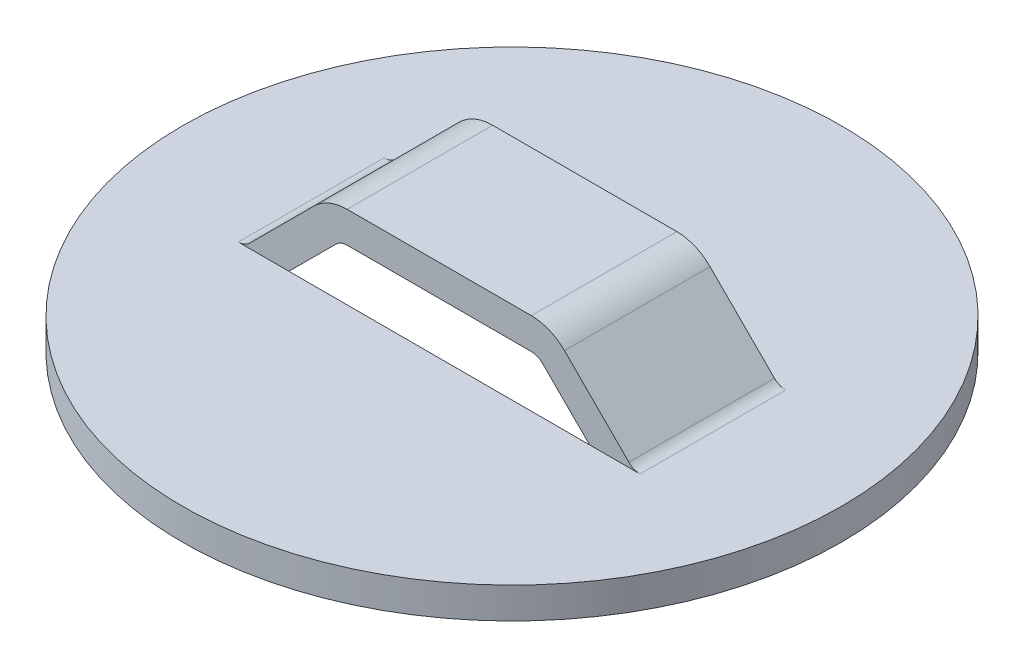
ISO-10303-21;
HEADER;
FILE_DESCRIPTION(('STEP AP214'),'2;1');
FILE_NAME('part.step','',(''),(''),'','','');
FILE_SCHEMA(('AUTOMOTIVE_DESIGN { 1 0 10303 214 1 1 1 1 }'));
ENDSEC;
DATA;
#1=APPLICATION_CONTEXT('core data for automotive mechanical design processes');
#2=APPLICATION_PROTOCOL_DEFINITION('international standard','automotive_design',2000,#1);
#3=PRODUCT_CONTEXT('',#1,'mechanical');
#4=PRODUCT('Part','Part','',(#3));
#5=PRODUCT_RELATED_PRODUCT_CATEGORY('part','',(#4));
#6=PRODUCT_DEFINITION_FORMATION('','',#4);
#7=PRODUCT_DEFINITION_CONTEXT('part definition',#1,'design');
#8=PRODUCT_DEFINITION('design','',#6,#7);
#9=PRODUCT_DEFINITION_SHAPE('','',#8);
#10=(LENGTH_UNIT() NAMED_UNIT(*) SI_UNIT(.MILLI.,.METRE.));
#11=(NAMED_UNIT(*) PLANE_ANGLE_UNIT() SI_UNIT($,.RADIAN.));
#12=(NAMED_UNIT(*) SI_UNIT($,.STERADIAN.) SOLID_ANGLE_UNIT());
#13=UNCERTAINTY_MEASURE_WITH_UNIT(LENGTH_MEASURE(1.E-05),#10,'distance_accuracy_value','');
#14=(GEOMETRIC_REPRESENTATION_CONTEXT(3) GLOBAL_UNCERTAINTY_ASSIGNED_CONTEXT((#13)) GLOBAL_UNIT_ASSIGNED_CONTEXT((#10,
#11,#12)) REPRESENTATION_CONTEXT('',''));
#15=CARTESIAN_POINT('',(0.,0.,0.));
#16=DIRECTION('',(0.,0.,1.));
#17=DIRECTION('',(1.,0.,0.));
#18=AXIS2_PLACEMENT_3D('',#15,#16,#17);
#19=CARTESIAN_POINT('',(-9.67553073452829,0.762,0.));
#20=DIRECTION('',(0.,0.,-1.));
#21=DIRECTION('',(-1.,0.,0.));
#22=AXIS2_PLACEMENT_3D('',#19,#20,#21);
#23=PLANE('',#22);
#24=DIRECTION('',(-1.,0.,0.));
#25=VECTOR('',#24,1.);
#26=CARTESIAN_POINT('',(-9.67553073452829,0.,0.));
#27=LINE('',#26,#25);
#28=CARTESIAN_POINT('',(-7.24055955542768,0.,0.));
#29=VERTEX_POINT('',#28);
#30=CARTESIAN_POINT('',(-9.67553073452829,0.,0.));
#31=VERTEX_POINT('',#30);
#32=EDGE_CURVE('E178',#29,#31,#27,.T.);
#33=ORIENTED_EDGE('',*,*,#32,.F.);
#34=DIRECTION('',(-0.707106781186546,-0.707106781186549,0.));
#35=VECTOR('',#34,1.);
#36=CARTESIAN_POINT('',(-4.97454418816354,2.26601536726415,0.));
#37=LINE('',#36,#35);
#38=CARTESIAN_POINT('',(-4.97454418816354,2.26601536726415,0.));
#39=VERTEX_POINT('',#38);
#40=EDGE_CURVE('E248',#39,#29,#37,.T.);
#41=ORIENTED_EDGE('',*,*,#40,.F.);
#42=CARTESIAN_POINT('',(-4.43572882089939,1.7272,0.));
#43=DIRECTION('',(0.,0.,1.));
#44=DIRECTION('',(1.,0.,0.));
#45=AXIS2_PLACEMENT_3D('',#42,#43,#44);
#46=CIRCLE('',#45,0.762);
#47=CARTESIAN_POINT('',(-4.43572882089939,2.4892,0.));
#48=VERTEX_POINT('',#47);
#49=EDGE_CURVE('E249',#48,#39,#46,.T.);
#50=ORIENTED_EDGE('',*,*,#49,.F.);
#51=DIRECTION('',(-1.,0.,0.));
#52=VECTOR('',#51,1.);
#53=CARTESIAN_POINT('',(-9.67553073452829,2.4892,0.));
#54=LINE('',#53,#52);
#55=CARTESIAN_POINT('',(4.43572882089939,2.4892,0.));
#56=VERTEX_POINT('',#55);
#57=EDGE_CURVE('E252',#56,#48,#54,.T.);
#58=ORIENTED_EDGE('',*,*,#57,.F.);
#59=CARTESIAN_POINT('',(4.43572882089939,1.7272,0.));
#60=DIRECTION('',(0.,0.,1.));
#61=DIRECTION('',(1.,0.,0.));
#62=AXIS2_PLACEMENT_3D('',#59,#60,#61);
#63=CIRCLE('',#62,0.762);
#64=CARTESIAN_POINT('',(4.97454418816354,2.26601536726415,0.));
#65=VERTEX_POINT('',#64);
#66=EDGE_CURVE('E253',#65,#56,#63,.T.);
#67=ORIENTED_EDGE('',*,*,#66,.F.);
#68=DIRECTION('',(-0.707106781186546,0.707106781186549,0.));
#69=VECTOR('',#68,1.);
#70=CARTESIAN_POINT('',(8.07704514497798,-0.836485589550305,0.));
#71=LINE('',#70,#69);
#72=CARTESIAN_POINT('',(7.24055955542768,0.,0.));
#73=VERTEX_POINT('',#72);
#74=EDGE_CURVE('E170',#73,#65,#71,.T.);
#75=ORIENTED_EDGE('',*,*,#74,.F.);
#76=CARTESIAN_POINT('',(9.67553073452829,0.,0.));
#77=VERTEX_POINT('',#76);
#78=EDGE_CURVE('E165',#77,#73,#27,.T.);
#79=ORIENTED_EDGE('',*,*,#78,.F.);
#80=CARTESIAN_POINT('',(9.67553073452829,0.762,0.));
#81=DIRECTION('',(0.,0.,1.));
#82=DIRECTION('',(1.,0.,0.));
#83=AXIS2_PLACEMENT_3D('',#80,#81,#82);
#84=CIRCLE('',#83,0.761999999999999);
#85=CARTESIAN_POINT('',(9.13671536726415,0.223184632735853,0.));
#86=VERTEX_POINT('',#85);
#87=EDGE_CURVE('E168',#86,#77,#84,.T.);
#88=ORIENTED_EDGE('',*,*,#87,.F.);
#89=DIRECTION('',(0.707106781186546,-0.707106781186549,0.));
#90=VECTOR('',#89,1.);
#91=CARTESIAN_POINT('',(6.0342144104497,3.32568558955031,0.));
#92=LINE('',#91,#90);
#93=CARTESIAN_POINT('',(6.0342144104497,3.32568558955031,0.));
#94=VERTEX_POINT('',#93);
#95=EDGE_CURVE('E186',#94,#86,#92,.T.);
#96=ORIENTED_EDGE('',*,*,#95,.F.);
#97=CARTESIAN_POINT('',(4.43572882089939,1.7272,0.));
#98=DIRECTION('',(0.,0.,1.));
#99=DIRECTION('',(1.,0.,0.));
#100=AXIS2_PLACEMENT_3D('',#97,#98,#99);
#101=CIRCLE('',#100,2.2606);
#102=CARTESIAN_POINT('',(4.43572882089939,3.9878,0.));
#103=VERTEX_POINT('',#102);
#104=EDGE_CURVE('E202',#103,#94,#101,.F.);
#105=ORIENTED_EDGE('',*,*,#104,.F.);
#106=DIRECTION('',(1.,0.,0.));
#107=VECTOR('',#106,1.);
#108=CARTESIAN_POINT('',(-4.43572882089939,3.9878,0.));
#109=LINE('',#108,#107);
#110=CARTESIAN_POINT('',(-4.43572882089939,3.9878,0.));
#111=VERTEX_POINT('',#110);
#112=EDGE_CURVE('E271',#111,#103,#109,.T.);
#113=ORIENTED_EDGE('',*,*,#112,.F.);
#114=CARTESIAN_POINT('',(-4.43572882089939,1.7272,0.));
#115=DIRECTION('',(0.,0.,1.));
#116=DIRECTION('',(1.,0.,0.));
#117=AXIS2_PLACEMENT_3D('',#114,#115,#116);
#118=CIRCLE('',#117,2.2606);
#119=CARTESIAN_POINT('',(-6.0342144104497,3.32568558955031,0.));
#120=VERTEX_POINT('',#119);
#121=EDGE_CURVE('E215',#120,#111,#118,.F.);
#122=ORIENTED_EDGE('',*,*,#121,.F.);
#123=DIRECTION('',(0.707106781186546,0.707106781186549,0.));
#124=VECTOR('',#123,1.);
#125=CARTESIAN_POINT('',(-9.13671536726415,0.223184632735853,0.));
#126=LINE('',#125,#124);
#127=CARTESIAN_POINT('',(-9.13671536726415,0.223184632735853,0.));
#128=VERTEX_POINT('',#127);
#129=EDGE_CURVE('E257',#128,#120,#126,.T.);
#130=ORIENTED_EDGE('',*,*,#129,.F.);
#131=CARTESIAN_POINT('',(-9.67553073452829,0.762,0.));
#132=DIRECTION('',(0.,0.,1.));
#133=DIRECTION('',(1.,0.,0.));
#134=AXIS2_PLACEMENT_3D('',#131,#132,#133);
#135=CIRCLE('',#134,0.761999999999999);
#136=EDGE_CURVE('E206',#31,#128,#135,.T.);
#137=ORIENTED_EDGE('',*,*,#136,.F.);
#138=EDGE_LOOP('',(#33,#41,#50,#58,#67,#75,#79,#88,#96,#105,#113,#122,#130,#137));
#139=FACE_BOUND('',#138,.T.);
#140=ADVANCED_FACE('F39',(#139),#23,.F.);
#141=CARTESIAN_POINT('',(-9.67553073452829,0.762,-7.0104));
#142=DIRECTION('',(0.,0.,-1.));
#143=DIRECTION('',(-1.,0.,0.));
#144=AXIS2_PLACEMENT_3D('',#141,#142,#143);
#145=PLANE('',#144);
#146=DIRECTION('',(-0.707106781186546,-0.707106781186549,0.));
#147=VECTOR('',#146,1.);
#148=CARTESIAN_POINT('',(-4.97454418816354,2.26601536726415,-7.0104));
#149=LINE('',#148,#147);
#150=CARTESIAN_POINT('',(-4.97454418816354,2.26601536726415,-7.0104));
#151=VERTEX_POINT('',#150);
#152=CARTESIAN_POINT('',(-7.24055955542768,0.,-7.0104));
#153=VERTEX_POINT('',#152);
#154=EDGE_CURVE('E221',#151,#153,#149,.T.);
#155=ORIENTED_EDGE('',*,*,#154,.T.);
#156=DIRECTION('',(1.,0.,0.));
#157=VECTOR('',#156,1.);
#158=CARTESIAN_POINT('',(-9.67553073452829,0.,-7.0104));
#159=LINE('',#158,#157);
#160=CARTESIAN_POINT('',(-9.67553073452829,0.,-7.0104));
#161=VERTEX_POINT('',#160);
#162=EDGE_CURVE('E329',#161,#153,#159,.T.);
#163=ORIENTED_EDGE('',*,*,#162,.F.);
#164=CARTESIAN_POINT('',(-9.67553073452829,0.762,-7.0104));
#165=DIRECTION('',(0.,0.,1.));
#166=DIRECTION('',(1.,0.,0.));
#167=AXIS2_PLACEMENT_3D('',#164,#165,#166);
#168=CIRCLE('',#167,0.761999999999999);
#169=CARTESIAN_POINT('',(-9.13671536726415,0.223184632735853,-7.0104));
#170=VERTEX_POINT('',#169);
#171=EDGE_CURVE('E201',#161,#170,#168,.T.);
#172=ORIENTED_EDGE('',*,*,#171,.T.);
#173=DIRECTION('',(0.707106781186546,0.707106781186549,0.));
#174=VECTOR('',#173,1.);
#175=CARTESIAN_POINT('',(-9.13671536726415,0.223184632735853,-7.0104));
#176=LINE('',#175,#174);
#177=CARTESIAN_POINT('',(-6.0342144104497,3.32568558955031,-7.0104));
#178=VERTEX_POINT('',#177);
#179=EDGE_CURVE('E240',#170,#178,#176,.T.);
#180=ORIENTED_EDGE('',*,*,#179,.T.);
#181=CARTESIAN_POINT('',(-4.43572882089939,1.7272,-7.0104));
#182=DIRECTION('',(0.,0.,1.));
#183=DIRECTION('',(1.,0.,0.));
#184=AXIS2_PLACEMENT_3D('',#181,#182,#183);
#185=CIRCLE('',#184,2.2606);
#186=CARTESIAN_POINT('',(-4.43572882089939,3.9878,-7.0104));
#187=VERTEX_POINT('',#186);
#188=EDGE_CURVE('E211',#187,#178,#185,.T.);
#189=ORIENTED_EDGE('',*,*,#188,.F.);
#190=DIRECTION('',(1.,0.,0.));
#191=VECTOR('',#190,1.);
#192=CARTESIAN_POINT('',(-4.43572882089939,3.9878,-7.0104));
#193=LINE('',#192,#191);
#194=CARTESIAN_POINT('',(4.43572882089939,3.9878,-7.0104));
#195=VERTEX_POINT('',#194);
#196=EDGE_CURVE('E308',#195,#187,#193,.F.);
#197=ORIENTED_EDGE('',*,*,#196,.F.);
#198=CARTESIAN_POINT('',(4.43572882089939,1.7272,-7.0104));
#199=DIRECTION('',(0.,0.,1.));
#200=DIRECTION('',(1.,0.,0.));
#201=AXIS2_PLACEMENT_3D('',#198,#199,#200);
#202=CIRCLE('',#201,2.2606);
#203=CARTESIAN_POINT('',(6.0342144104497,3.32568558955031,-7.0104));
#204=VERTEX_POINT('',#203);
#205=EDGE_CURVE('E237',#195,#204,#202,.F.);
#206=ORIENTED_EDGE('',*,*,#205,.T.);
#207=DIRECTION('',(0.707106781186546,-0.707106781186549,0.));
#208=VECTOR('',#207,1.);
#209=CARTESIAN_POINT('',(6.0342144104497,3.32568558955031,-7.0104));
#210=LINE('',#209,#208);
#211=CARTESIAN_POINT('',(9.13671536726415,0.223184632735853,-7.0104));
#212=VERTEX_POINT('',#211);
#213=EDGE_CURVE('E236',#204,#212,#210,.T.);
#214=ORIENTED_EDGE('',*,*,#213,.T.);
#215=CARTESIAN_POINT('',(9.67553073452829,0.762,-7.0104));
#216=DIRECTION('',(0.,0.,1.));
#217=DIRECTION('',(1.,0.,0.));
#218=AXIS2_PLACEMENT_3D('',#215,#216,#217);
#219=CIRCLE('',#218,0.761999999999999);
#220=CARTESIAN_POINT('',(9.67553073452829,0.,-7.0104));
#221=VERTEX_POINT('',#220);
#222=EDGE_CURVE('E234',#212,#221,#219,.T.);
#223=ORIENTED_EDGE('',*,*,#222,.T.);
#224=DIRECTION('',(-1.,0.,0.));
#225=VECTOR('',#224,1.);
#226=CARTESIAN_POINT('',(-9.67553073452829,0.,-7.0104));
#227=LINE('',#226,#225);
#228=CARTESIAN_POINT('',(7.24055955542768,0.,-7.0104));
#229=VERTEX_POINT('',#228);
#230=EDGE_CURVE('E11',#221,#229,#227,.T.);
#231=ORIENTED_EDGE('',*,*,#230,.T.);
#232=DIRECTION('',(-0.707106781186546,0.707106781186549,0.));
#233=VECTOR('',#232,1.);
#234=CARTESIAN_POINT('',(8.07704514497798,-0.836485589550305,-7.0104));
#235=LINE('',#234,#233);
#236=CARTESIAN_POINT('',(4.97454418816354,2.26601536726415,-7.0104));
#237=VERTEX_POINT('',#236);
#238=EDGE_CURVE('E233',#229,#237,#235,.T.);
#239=ORIENTED_EDGE('',*,*,#238,.T.);
#240=CARTESIAN_POINT('',(4.43572882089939,1.7272,-7.0104));
#241=DIRECTION('',(0.,0.,1.));
#242=DIRECTION('',(1.,0.,0.));
#243=AXIS2_PLACEMENT_3D('',#240,#241,#242);
#244=CIRCLE('',#243,0.762);
#245=CARTESIAN_POINT('',(4.43572882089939,2.4892,-7.0104));
#246=VERTEX_POINT('',#245);
#247=EDGE_CURVE('E226',#237,#246,#244,.T.);
#248=ORIENTED_EDGE('',*,*,#247,.T.);
#249=DIRECTION('',(-1.,0.,0.));
#250=VECTOR('',#249,1.);
#251=CARTESIAN_POINT('',(-9.67553073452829,2.4892,-7.0104));
#252=LINE('',#251,#250);
#253=CARTESIAN_POINT('',(-4.43572882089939,2.4892,-7.0104));
#254=VERTEX_POINT('',#253);
#255=EDGE_CURVE('E225',#246,#254,#252,.T.);
#256=ORIENTED_EDGE('',*,*,#255,.T.);
#257=CARTESIAN_POINT('',(-4.43572882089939,1.7272,-7.0104));
#258=DIRECTION('',(0.,0.,1.));
#259=DIRECTION('',(1.,0.,0.));
#260=AXIS2_PLACEMENT_3D('',#257,#258,#259);
#261=CIRCLE('',#260,0.762);
#262=EDGE_CURVE('E222',#254,#151,#261,.T.);
#263=ORIENTED_EDGE('',*,*,#262,.T.);
#264=EDGE_LOOP('',(#155,#163,#172,#180,#189,#197,#206,#214,#223,#231,#239,#248,#256,#263));
#265=FACE_BOUND('',#264,.T.);
#266=ADVANCED_FACE('F347',(#265),#145,.T.);
#267=CARTESIAN_POINT('',(-9.67553073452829,0.762,-7.0104));
#268=DIRECTION('',(0.,0.,1.));
#269=DIRECTION('',(1.,0.,0.));
#270=AXIS2_PLACEMENT_3D('',#267,#268,#269);
#271=CYLINDRICAL_SURFACE('',#270,0.761999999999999);
#272=DIRECTION('',(0.,0.,1.));
#273=VECTOR('',#272,1.);
#274=CARTESIAN_POINT('',(-9.13671536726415,0.223184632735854,-7.0104));
#275=LINE('',#274,#273);
#276=EDGE_CURVE('E203',#170,#128,#275,.T.);
#277=ORIENTED_EDGE('',*,*,#276,.F.);
#278=ORIENTED_EDGE('',*,*,#171,.F.);
#279=DIRECTION('',(0.,0.,1.));
#280=VECTOR('',#279,1.);
#281=CARTESIAN_POINT('',(-9.67553073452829,0.,-7.0104));
#282=LINE('',#281,#280);
#283=EDGE_CURVE('E195',#31,#161,#282,.F.);
#284=ORIENTED_EDGE('',*,*,#283,.F.);
#285=ORIENTED_EDGE('',*,*,#136,.T.);
#286=EDGE_LOOP('',(#277,#278,#284,#285));
#287=FACE_BOUND('',#286,.T.);
#288=ADVANCED_FACE('F41',(#287),#271,.F.);
#289=CARTESIAN_POINT('',(6.0342144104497,3.32568558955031,-7.0104));
#290=DIRECTION('',(0.707106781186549,0.707106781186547,0.));
#291=DIRECTION('',(-0.707106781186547,0.707106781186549,0.));
#292=AXIS2_PLACEMENT_3D('',#289,#290,#291);
#293=PLANE('',#292);
#294=ORIENTED_EDGE('',*,*,#213,.F.);
#295=DIRECTION('',(0.,0.,1.));
#296=VECTOR('',#295,1.);
#297=CARTESIAN_POINT('',(6.0342144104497,3.32568558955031,-7.0104));
#298=LINE('',#297,#296);
#299=EDGE_CURVE('E199',#94,#204,#298,.F.);
#300=ORIENTED_EDGE('',*,*,#299,.F.);
#301=ORIENTED_EDGE('',*,*,#95,.T.);
#302=DIRECTION('',(0.,0.,1.));
#303=VECTOR('',#302,1.);
#304=CARTESIAN_POINT('',(9.13671536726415,0.223184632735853,-7.0104));
#305=LINE('',#304,#303);
#306=EDGE_CURVE('E184',#86,#212,#305,.F.);
#307=ORIENTED_EDGE('',*,*,#306,.T.);
#308=EDGE_LOOP('',(#294,#300,#301,#307));
#309=FACE_BOUND('',#308,.T.);
#310=ADVANCED_FACE('F502',(#309),#293,.T.);
#311=CARTESIAN_POINT('',(9.67553073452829,0.762,-7.0104));
#312=DIRECTION('',(0.,0.,1.));
#313=DIRECTION('',(1.,0.,0.));
#314=AXIS2_PLACEMENT_3D('',#311,#312,#313);
#315=CYLINDRICAL_SURFACE('',#314,0.761999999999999);
#316=DIRECTION('',(0.,0.,1.));
#317=VECTOR('',#316,1.);
#318=CARTESIAN_POINT('',(9.67553073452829,0.,-7.0104));
#319=LINE('',#318,#317);
#320=EDGE_CURVE('E183',#221,#77,#319,.T.);
#321=ORIENTED_EDGE('',*,*,#320,.F.);
#322=ORIENTED_EDGE('',*,*,#222,.F.);
#323=ORIENTED_EDGE('',*,*,#306,.F.);
#324=ORIENTED_EDGE('',*,*,#87,.T.);
#325=EDGE_LOOP('',(#321,#322,#323,#324));
#326=FACE_BOUND('',#325,.T.);
#327=ADVANCED_FACE('F181',(#326),#315,.F.);
#328=CARTESIAN_POINT('',(9.67553073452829,0.,-7.0104));
#329=DIRECTION('',(0.,1.,0.));
#330=DIRECTION('',(0.,0.,1.));
#331=AXIS2_PLACEMENT_3D('',#328,#329,#330);
#332=PLANE('',#331);
#333=CARTESIAN_POINT('',(0.,0.,-3.5052));
#334=DIRECTION('',(0.,-1.,0.));
#335=DIRECTION('',(1.,0.,0.));
#336=AXIS2_PLACEMENT_3D('',#333,#334,#335);
#337=CIRCLE('',#336,15.875);
#338=CARTESIAN_POINT('',(15.875,0.,-3.5052));
#339=VERTEX_POINT('',#338);
#340=EDGE_CURVE('E210',#339,#339,#337,.T.);
#341=ORIENTED_EDGE('',*,*,#340,.F.);
#342=EDGE_LOOP('',(#341));
#343=FACE_BOUND('',#342,.T.);
#344=ORIENTED_EDGE('',*,*,#320,.T.);
#345=ORIENTED_EDGE('',*,*,#78,.T.);
#346=EDGE_CURVE('E176',#73,#29,#27,.T.);
#347=ORIENTED_EDGE('',*,*,#346,.T.);
#348=ORIENTED_EDGE('',*,*,#32,.T.);
#349=ORIENTED_EDGE('',*,*,#283,.T.);
#350=ORIENTED_EDGE('',*,*,#162,.T.);
#351=EDGE_CURVE('E325',#153,#229,#159,.T.);
#352=ORIENTED_EDGE('',*,*,#351,.T.);
#353=ORIENTED_EDGE('',*,*,#230,.F.);
#354=EDGE_LOOP('',(#344,#345,#347,#348,#349,#350,#352,#353));
#355=FACE_BOUND('',#354,.T.);
#356=ADVANCED_FACE('F188',(#343,#355),#332,.T.);
#357=CARTESIAN_POINT('',(9.67553073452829,0.762,-7.0104));
#358=DIRECTION('',(0.,0.,1.));
#359=DIRECTION('',(1.,0.,0.));
#360=AXIS2_PLACEMENT_3D('',#357,#358,#359);
#361=CYLINDRICAL_SURFACE('',#360,2.2606);
#362=CARTESIAN_POINT('',(9.67553073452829,0.762,-7.0104));
#363=DIRECTION('',(0.,0.,1.));
#364=DIRECTION('',(1.,0.,0.));
#365=AXIS2_PLACEMENT_3D('',#362,#363,#364);
#366=CIRCLE('',#365,2.2606);
#367=CARTESIAN_POINT('',(9.67553073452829,-1.4986,-7.0104));
#368=VERTEX_POINT('',#367);
#369=CARTESIAN_POINT('',(8.07704514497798,-0.836485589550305,-7.0104));
#370=VERTEX_POINT('',#369);
#371=EDGE_CURVE('E230',#368,#370,#366,.F.);
#372=ORIENTED_EDGE('',*,*,#371,.F.);
#373=DIRECTION('',(0.,0.,1.));
#374=VECTOR('',#373,1.);
#375=CARTESIAN_POINT('',(9.67553073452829,-1.4986,-7.0104));
#376=LINE('',#375,#374);
#377=CARTESIAN_POINT('',(9.67553073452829,-1.4986,0.));
#378=VERTEX_POINT('',#377);
#379=EDGE_CURVE('E190',#368,#378,#376,.T.);
#380=ORIENTED_EDGE('',*,*,#379,.T.);
#381=CARTESIAN_POINT('',(9.67553073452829,0.762,0.));
#382=DIRECTION('',(0.,0.,1.));
#383=DIRECTION('',(1.,0.,0.));
#384=AXIS2_PLACEMENT_3D('',#381,#382,#383);
#385=CIRCLE('',#384,2.2606);
#386=CARTESIAN_POINT('',(8.07704514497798,-0.836485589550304,0.));
#387=VERTEX_POINT('',#386);
#388=EDGE_CURVE('E185',#378,#387,#385,.F.);
#389=ORIENTED_EDGE('',*,*,#388,.T.);
#390=DIRECTION('',(0.,0.,1.));
#391=VECTOR('',#390,1.);
#392=CARTESIAN_POINT('',(8.07704514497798,-0.836485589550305,-7.0104));
#393=LINE('',#392,#391);
#394=EDGE_CURVE('E193',#370,#387,#393,.T.);
#395=ORIENTED_EDGE('',*,*,#394,.F.);
#396=EDGE_LOOP('',(#372,#380,#389,#395));
#397=FACE_BOUND('',#396,.T.);
#398=ADVANCED_FACE('F293',(#397),#361,.T.);
#399=CARTESIAN_POINT('',(4.97454418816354,2.26601536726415,-7.0104));
#400=DIRECTION('',(-0.707106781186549,-0.707106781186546,0.));
#401=DIRECTION('',(0.707106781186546,-0.707106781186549,0.));
#402=AXIS2_PLACEMENT_3D('',#399,#400,#401);
#403=PLANE('',#402);
#404=EDGE_CURVE('E229',#370,#229,#235,.T.);
#405=ORIENTED_EDGE('',*,*,#404,.F.);
#406=ORIENTED_EDGE('',*,*,#394,.T.);
#407=EDGE_CURVE('E255',#387,#73,#71,.T.);
#408=ORIENTED_EDGE('',*,*,#407,.T.);
#409=ORIENTED_EDGE('',*,*,#74,.T.);
#410=DIRECTION('',(0.,0.,1.));
#411=VECTOR('',#410,1.);
#412=CARTESIAN_POINT('',(4.97454418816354,2.26601536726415,-7.0104));
#413=LINE('',#412,#411);
#414=EDGE_CURVE('E285',#65,#237,#413,.F.);
#415=ORIENTED_EDGE('',*,*,#414,.T.);
#416=ORIENTED_EDGE('',*,*,#238,.F.);
#417=EDGE_LOOP('',(#405,#406,#408,#409,#415,#416));
#418=FACE_BOUND('',#417,.T.);
#419=ADVANCED_FACE('F290',(#418),#403,.T.);
#420=CARTESIAN_POINT('',(4.43572882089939,1.7272,-7.0104));
#421=DIRECTION('',(0.,0.,1.));
#422=DIRECTION('',(1.,0.,0.));
#423=AXIS2_PLACEMENT_3D('',#420,#421,#422);
#424=CYLINDRICAL_SURFACE('',#423,0.762);
#425=DIRECTION('',(0.,0.,1.));
#426=VECTOR('',#425,1.);
#427=CARTESIAN_POINT('',(4.43572882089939,2.4892,-7.0104));
#428=LINE('',#427,#426);
#429=EDGE_CURVE('E282',#246,#56,#428,.T.);
#430=ORIENTED_EDGE('',*,*,#429,.F.);
#431=ORIENTED_EDGE('',*,*,#247,.F.);
#432=ORIENTED_EDGE('',*,*,#414,.F.);
#433=ORIENTED_EDGE('',*,*,#66,.T.);
#434=EDGE_LOOP('',(#430,#431,#432,#433));
#435=FACE_BOUND('',#434,.T.);
#436=ADVANCED_FACE('F357',(#435),#424,.F.);
#437=CARTESIAN_POINT('',(-4.43572882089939,2.4892,-7.0104));
#438=DIRECTION('',(0.,-1.,0.));
#439=DIRECTION('',(1.,0.,0.));
#440=AXIS2_PLACEMENT_3D('',#437,#438,#439);
#441=PLANE('',#440);
#442=ORIENTED_EDGE('',*,*,#255,.F.);
#443=ORIENTED_EDGE('',*,*,#429,.T.);
#444=ORIENTED_EDGE('',*,*,#57,.T.);
#445=DIRECTION('',(0.,0.,1.));
#446=VECTOR('',#445,1.);
#447=CARTESIAN_POINT('',(-4.43572882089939,2.4892,-7.0104));
#448=LINE('',#447,#446);
#449=EDGE_CURVE('E280',#48,#254,#448,.F.);
#450=ORIENTED_EDGE('',*,*,#449,.T.);
#451=EDGE_LOOP('',(#442,#443,#444,#450));
#452=FACE_BOUND('',#451,.T.);
#453=ADVANCED_FACE('F354',(#452),#441,.T.);
#454=CARTESIAN_POINT('',(-4.43572882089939,1.7272,-7.0104));
#455=DIRECTION('',(0.,0.,1.));
#456=DIRECTION('',(1.,0.,0.));
#457=AXIS2_PLACEMENT_3D('',#454,#455,#456);
#458=CYLINDRICAL_SURFACE('',#457,0.762);
#459=DIRECTION('',(0.,0.,1.));
#460=VECTOR('',#459,1.);
#461=CARTESIAN_POINT('',(-4.97454418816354,2.26601536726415,-7.0104));
#462=LINE('',#461,#460);
#463=EDGE_CURVE('E277',#151,#39,#462,.T.);
#464=ORIENTED_EDGE('',*,*,#463,.F.);
#465=ORIENTED_EDGE('',*,*,#262,.F.);
#466=ORIENTED_EDGE('',*,*,#449,.F.);
#467=ORIENTED_EDGE('',*,*,#49,.T.);
#468=EDGE_LOOP('',(#464,#465,#466,#467));
#469=FACE_BOUND('',#468,.T.);
#470=ADVANCED_FACE('F352',(#469),#458,.F.);
#471=CARTESIAN_POINT('',(-8.07704514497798,-0.836485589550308,-7.0104));
#472=DIRECTION('',(0.707106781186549,-0.707106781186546,0.));
#473=DIRECTION('',(0.707106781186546,0.707106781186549,0.));
#474=AXIS2_PLACEMENT_3D('',#471,#472,#473);
#475=PLANE('',#474);
#476=ORIENTED_EDGE('',*,*,#154,.F.);
#477=ORIENTED_EDGE('',*,*,#463,.T.);
#478=ORIENTED_EDGE('',*,*,#40,.T.);
#479=CARTESIAN_POINT('',(-8.07704514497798,-0.836485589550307,0.));
#480=VERTEX_POINT('',#479);
#481=EDGE_CURVE('E251',#29,#480,#37,.T.);
#482=ORIENTED_EDGE('',*,*,#481,.T.);
#483=DIRECTION('',(0.,0.,1.));
#484=VECTOR('',#483,1.);
#485=CARTESIAN_POINT('',(-8.07704514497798,-0.836485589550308,-7.0104));
#486=LINE('',#485,#484);
#487=CARTESIAN_POINT('',(-8.07704514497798,-0.836485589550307,-7.0104));
#488=VERTEX_POINT('',#487);
#489=EDGE_CURVE('E274',#488,#480,#486,.T.);
#490=ORIENTED_EDGE('',*,*,#489,.F.);
#491=EDGE_CURVE('E54',#153,#488,#149,.T.);
#492=ORIENTED_EDGE('',*,*,#491,.F.);
#493=EDGE_LOOP('',(#476,#477,#478,#482,#490,#492));
#494=FACE_BOUND('',#493,.T.);
#495=ADVANCED_FACE('F341',(#494),#475,.T.);
#496=CARTESIAN_POINT('',(-9.67553073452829,0.762,-7.0104));
#497=DIRECTION('',(0.,0.,1.));
#498=DIRECTION('',(1.,0.,0.));
#499=AXIS2_PLACEMENT_3D('',#496,#497,#498);
#500=CYLINDRICAL_SURFACE('',#499,2.2606);
#501=CARTESIAN_POINT('',(-9.67553073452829,0.762,-7.0104));
#502=DIRECTION('',(0.,0.,1.));
#503=DIRECTION('',(1.,0.,0.));
#504=AXIS2_PLACEMENT_3D('',#501,#502,#503);
#505=CIRCLE('',#504,2.2606);
#506=CARTESIAN_POINT('',(-9.67553073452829,-1.4986,-7.0104));
#507=VERTEX_POINT('',#506);
#508=EDGE_CURVE('E218',#488,#507,#505,.F.);
#509=ORIENTED_EDGE('',*,*,#508,.F.);
#510=ORIENTED_EDGE('',*,*,#489,.T.);
#511=CARTESIAN_POINT('',(-9.67553073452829,0.762,0.));
#512=DIRECTION('',(0.,0.,1.));
#513=DIRECTION('',(1.,0.,0.));
#514=AXIS2_PLACEMENT_3D('',#511,#512,#513);
#515=CIRCLE('',#514,2.2606);
#516=CARTESIAN_POINT('',(-9.67553073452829,-1.4986,0.));
#517=VERTEX_POINT('',#516);
#518=EDGE_CURVE('E245',#480,#517,#515,.F.);
#519=ORIENTED_EDGE('',*,*,#518,.T.);
#520=DIRECTION('',(0.,0.,-1.));
#521=VECTOR('',#520,1.);
#522=CARTESIAN_POINT('',(-9.67553073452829,-1.4986,-7.0104));
#523=LINE('',#522,#521);
#524=EDGE_CURVE('E207',#507,#517,#523,.F.);
#525=ORIENTED_EDGE('',*,*,#524,.F.);
#526=EDGE_LOOP('',(#509,#510,#519,#525));
#527=FACE_BOUND('',#526,.T.);
#528=ADVANCED_FACE('F339',(#527),#500,.T.);
#529=CARTESIAN_POINT('',(-15.875,-1.4986,-7.0104));
#530=DIRECTION('',(0.,-1.,0.));
#531=DIRECTION('',(0.,0.,-1.));
#532=AXIS2_PLACEMENT_3D('',#529,#530,#531);
#533=PLANE('',#532);
#534=CARTESIAN_POINT('',(0.,-1.4986,-3.5052));
#535=DIRECTION('',(0.,-1.,0.));
#536=DIRECTION('',(1.,0.,0.));
#537=AXIS2_PLACEMENT_3D('',#534,#535,#536);
#538=CIRCLE('',#537,15.875);
#539=CARTESIAN_POINT('',(15.875,-1.4986,-3.5052));
#540=VERTEX_POINT('',#539);
#541=EDGE_CURVE('E175',#540,#540,#538,.T.);
#542=ORIENTED_EDGE('',*,*,#541,.T.);
#543=EDGE_LOOP('',(#542));
#544=FACE_BOUND('',#543,.T.);
#545=DIRECTION('',(-1.,0.,0.));
#546=VECTOR('',#545,1.);
#547=CARTESIAN_POINT('',(-9.67553073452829,-1.4986,0.));
#548=LINE('',#547,#546);
#549=EDGE_CURVE('E298',#378,#517,#548,.T.);
#550=ORIENTED_EDGE('',*,*,#549,.F.);
#551=ORIENTED_EDGE('',*,*,#379,.F.);
#552=DIRECTION('',(1.,0.,0.));
#553=VECTOR('',#552,1.);
#554=CARTESIAN_POINT('',(-9.67553073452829,-1.4986,-7.0104));
#555=LINE('',#554,#553);
#556=EDGE_CURVE('E326',#507,#368,#555,.T.);
#557=ORIENTED_EDGE('',*,*,#556,.F.);
#558=ORIENTED_EDGE('',*,*,#524,.T.);
#559=EDGE_LOOP('',(#550,#551,#557,#558));
#560=FACE_BOUND('',#559,.T.);
#561=ADVANCED_FACE('F337',(#544,#560),#533,.T.);
#562=CARTESIAN_POINT('',(-9.13671536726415,0.223184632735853,-7.0104));
#563=DIRECTION('',(-0.707106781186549,0.707106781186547,0.));
#564=DIRECTION('',(-0.707106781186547,-0.707106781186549,0.));
#565=AXIS2_PLACEMENT_3D('',#562,#563,#564);
#566=PLANE('',#565);
#567=ORIENTED_EDGE('',*,*,#179,.F.);
#568=ORIENTED_EDGE('',*,*,#276,.T.);
#569=ORIENTED_EDGE('',*,*,#129,.T.);
#570=DIRECTION('',(0.,0.,1.));
#571=VECTOR('',#570,1.);
#572=CARTESIAN_POINT('',(-6.0342144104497,3.32568558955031,-7.0104));
#573=LINE('',#572,#571);
#574=EDGE_CURVE('E214',#178,#120,#573,.T.);
#575=ORIENTED_EDGE('',*,*,#574,.F.);
#576=EDGE_LOOP('',(#567,#568,#569,#575));
#577=FACE_BOUND('',#576,.T.);
#578=ADVANCED_FACE('F377',(#577),#566,.T.);
#579=CARTESIAN_POINT('',(4.43572882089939,1.7272,-7.0104));
#580=DIRECTION('',(0.,0.,1.));
#581=DIRECTION('',(1.,0.,0.));
#582=AXIS2_PLACEMENT_3D('',#579,#580,#581);
#583=CYLINDRICAL_SURFACE('',#582,2.2606);
#584=ORIENTED_EDGE('',*,*,#205,.F.);
#585=DIRECTION('',(0.,0.,1.));
#586=VECTOR('',#585,1.);
#587=CARTESIAN_POINT('',(4.43572882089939,3.9878,-7.0104));
#588=LINE('',#587,#586);
#589=EDGE_CURVE('E305',#103,#195,#588,.F.);
#590=ORIENTED_EDGE('',*,*,#589,.F.);
#591=ORIENTED_EDGE('',*,*,#104,.T.);
#592=ORIENTED_EDGE('',*,*,#299,.T.);
#593=EDGE_LOOP('',(#584,#590,#591,#592));
#594=FACE_BOUND('',#593,.T.);
#595=ADVANCED_FACE('F376',(#594),#583,.T.);
#596=CARTESIAN_POINT('',(-4.43572882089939,1.7272,-7.0104));
#597=DIRECTION('',(0.,0.,1.));
#598=DIRECTION('',(1.,0.,0.));
#599=AXIS2_PLACEMENT_3D('',#596,#597,#598);
#600=CYLINDRICAL_SURFACE('',#599,2.2606);
#601=ORIENTED_EDGE('',*,*,#188,.T.);
#602=ORIENTED_EDGE('',*,*,#574,.T.);
#603=ORIENTED_EDGE('',*,*,#121,.T.);
#604=DIRECTION('',(0.,0.,1.));
#605=VECTOR('',#604,1.);
#606=CARTESIAN_POINT('',(-4.43572882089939,3.9878,-7.0104));
#607=LINE('',#606,#605);
#608=EDGE_CURVE('E47',#187,#111,#607,.T.);
#609=ORIENTED_EDGE('',*,*,#608,.F.);
#610=EDGE_LOOP('',(#601,#602,#603,#609));
#611=FACE_BOUND('',#610,.T.);
#612=ADVANCED_FACE('F421',(#611),#600,.T.);
#613=CARTESIAN_POINT('',(-4.43572882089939,3.9878,-7.0104));
#614=DIRECTION('',(0.,1.,0.));
#615=DIRECTION('',(0.,0.,1.));
#616=AXIS2_PLACEMENT_3D('',#613,#614,#615);
#617=PLANE('',#616);
#618=ORIENTED_EDGE('',*,*,#196,.T.);
#619=ORIENTED_EDGE('',*,*,#608,.T.);
#620=ORIENTED_EDGE('',*,*,#112,.T.);
#621=ORIENTED_EDGE('',*,*,#589,.T.);
#622=EDGE_LOOP('',(#618,#619,#620,#621));
#623=FACE_BOUND('',#622,.T.);
#624=ADVANCED_FACE('F373',(#623),#617,.T.);
#625=CARTESIAN_POINT('',(0.,0.,-3.5052));
#626=DIRECTION('',(0.,-1.,0.));
#627=DIRECTION('',(1.,0.,0.));
#628=AXIS2_PLACEMENT_3D('',#625,#626,#627);
#629=CYLINDRICAL_SURFACE('',#628,15.875);
#630=ORIENTED_EDGE('',*,*,#340,.T.);
#631=EDGE_LOOP('',(#630));
#632=FACE_BOUND('',#631,.T.);
#633=ORIENTED_EDGE('',*,*,#541,.F.);
#634=EDGE_LOOP('',(#633));
#635=FACE_BOUND('',#634,.T.);
#636=ADVANCED_FACE('F437',(#632,#635),#629,.T.);
#637=CARTESIAN_POINT('',(-9.67553073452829,0.,-7.0104));
#638=DIRECTION('',(0.,0.,-1.));
#639=DIRECTION('',(-1.,0.,0.));
#640=AXIS2_PLACEMENT_3D('',#637,#638,#639);
#641=PLANE('',#640);
#642=ORIENTED_EDGE('',*,*,#371,.T.);
#643=ORIENTED_EDGE('',*,*,#404,.T.);
#644=ORIENTED_EDGE('',*,*,#351,.F.);
#645=ORIENTED_EDGE('',*,*,#491,.T.);
#646=ORIENTED_EDGE('',*,*,#508,.T.);
#647=ORIENTED_EDGE('',*,*,#556,.T.);
#648=EDGE_LOOP('',(#642,#643,#644,#645,#646,#647));
#649=FACE_BOUND('',#648,.T.);
#650=ADVANCED_FACE('F333',(#649),#641,.F.);
#651=CARTESIAN_POINT('',(-9.67553073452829,0.,0.));
#652=DIRECTION('',(0.,0.,1.));
#653=DIRECTION('',(1.,0.,0.));
#654=AXIS2_PLACEMENT_3D('',#651,#652,#653);
#655=PLANE('',#654);
#656=ORIENTED_EDGE('',*,*,#388,.F.);
#657=ORIENTED_EDGE('',*,*,#549,.T.);
#658=ORIENTED_EDGE('',*,*,#518,.F.);
#659=ORIENTED_EDGE('',*,*,#481,.F.);
#660=ORIENTED_EDGE('',*,*,#346,.F.);
#661=ORIENTED_EDGE('',*,*,#407,.F.);
#662=EDGE_LOOP('',(#656,#657,#658,#659,#660,#661));
#663=FACE_BOUND('',#662,.T.);
#664=ADVANCED_FACE('F297',(#663),#655,.F.);
#665=CLOSED_SHELL('',(#140,#266,#288,#310,#327,#356,#398,#419,#436,#453,#470,#495,#528,#561,
#578,#595,#612,#624,#636,#650,#664));
#666=MANIFOLD_SOLID_BREP('B2',#665);
#667=ADVANCED_BREP_SHAPE_REPRESENTATION('',(#18,#666),#14);
#668=SHAPE_DEFINITION_REPRESENTATION(#9,#667);
ENDSEC;
END-ISO-10303-21;
